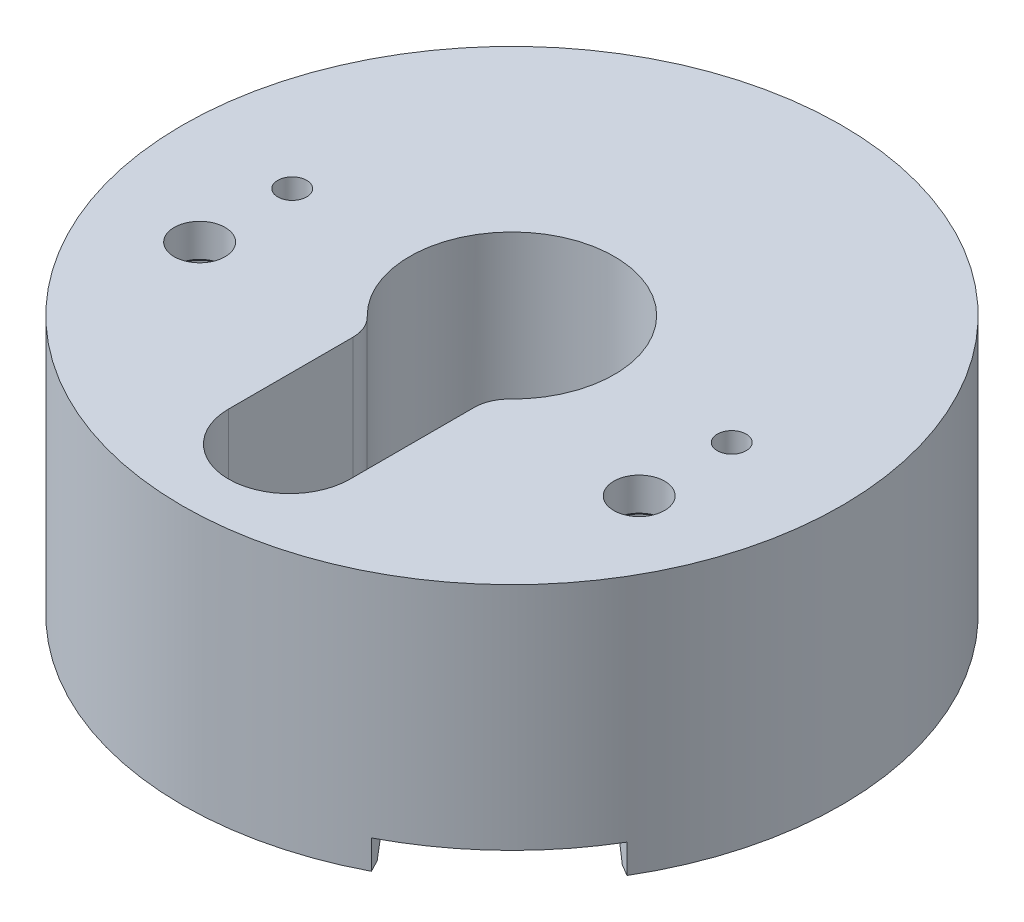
ISO-10303-21;
HEADER;
FILE_DESCRIPTION(('STEP AP214'),'2;1');
FILE_NAME('part.step','',(''),(''),'','','');
FILE_SCHEMA(('AUTOMOTIVE_DESIGN { 1 0 10303 214 1 1 1 1 }'));
ENDSEC;
DATA;
#1=APPLICATION_CONTEXT('core data for automotive mechanical design processes');
#2=APPLICATION_PROTOCOL_DEFINITION('international standard','automotive_design',2000,#1);
#3=PRODUCT_CONTEXT('',#1,'mechanical');
#4=PRODUCT('Part','Part','',(#3));
#5=PRODUCT_RELATED_PRODUCT_CATEGORY('part','',(#4));
#6=PRODUCT_DEFINITION_FORMATION('','',#4);
#7=PRODUCT_DEFINITION_CONTEXT('part definition',#1,'design');
#8=PRODUCT_DEFINITION('design','',#6,#7);
#9=PRODUCT_DEFINITION_SHAPE('','',#8);
#10=(LENGTH_UNIT() NAMED_UNIT(*) SI_UNIT(.MILLI.,.METRE.));
#11=(NAMED_UNIT(*) PLANE_ANGLE_UNIT() SI_UNIT($,.RADIAN.));
#12=(NAMED_UNIT(*) SI_UNIT($,.STERADIAN.) SOLID_ANGLE_UNIT());
#13=UNCERTAINTY_MEASURE_WITH_UNIT(LENGTH_MEASURE(1.E-05),#10,'distance_accuracy_value','');
#14=(GEOMETRIC_REPRESENTATION_CONTEXT(3) GLOBAL_UNCERTAINTY_ASSIGNED_CONTEXT((#13)) GLOBAL_UNIT_ASSIGNED_CONTEXT((#10,
#11,#12)) REPRESENTATION_CONTEXT('',''));
#15=CARTESIAN_POINT('',(0.,0.,0.));
#16=DIRECTION('',(0.,0.,1.));
#17=DIRECTION('',(1.,0.,0.));
#18=AXIS2_PLACEMENT_3D('',#15,#16,#17);
#19=CARTESIAN_POINT('',(19.,19.3,8.));
#20=DIRECTION('',(0.,1.,0.));
#21=DIRECTION('',(0.,0.,1.));
#22=AXIS2_PLACEMENT_3D('',#19,#20,#21);
#23=PLANE('',#22);
#24=CARTESIAN_POINT('',(19.,19.3,8.));
#25=DIRECTION('',(0.,-1.,0.));
#26=DIRECTION('',(0.,0.,-1.));
#27=AXIS2_PLACEMENT_3D('',#24,#25,#26);
#28=CIRCLE('',#27,2.54);
#29=CARTESIAN_POINT('',(19.,19.3,5.46000000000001));
#30=VERTEX_POINT('',#29);
#31=EDGE_CURVE('E358',#30,#30,#28,.T.);
#32=ORIENTED_EDGE('',*,*,#31,.T.);
#33=EDGE_LOOP('',(#32));
#34=FACE_BOUND('',#33,.T.);
#35=CARTESIAN_POINT('',(19.,19.3,8.));
#36=DIRECTION('',(0.,-1.,0.));
#37=DIRECTION('',(0.,0.,-1.));
#38=AXIS2_PLACEMENT_3D('',#35,#36,#37);
#39=CIRCLE('',#38,2.45);
#40=CARTESIAN_POINT('',(19.,19.3,5.55));
#41=VERTEX_POINT('',#40);
#42=EDGE_CURVE('E492',#41,#41,#39,.T.);
#43=ORIENTED_EDGE('',*,*,#42,.F.);
#44=EDGE_LOOP('',(#43));
#45=FACE_BOUND('',#44,.T.);
#46=ADVANCED_FACE('F46',(#34,#45),#23,.F.);
#47=CARTESIAN_POINT('',(0.,22.4,0.));
#48=DIRECTION('',(0.,-1.,0.));
#49=DIRECTION('',(0.,0.,-1.));
#50=AXIS2_PLACEMENT_3D('',#47,#48,#49);
#51=CYLINDRICAL_SURFACE('',#50,28.5);
#52=CARTESIAN_POINT('',(0.,22.4,0.));
#53=DIRECTION('',(0.,1.,0.));
#54=DIRECTION('',(0.,0.,1.));
#55=AXIS2_PLACEMENT_3D('',#52,#53,#54);
#56=CIRCLE('',#55,28.5);
#57=CARTESIAN_POINT('',(0.,22.4,28.5));
#58=VERTEX_POINT('',#57);
#59=EDGE_CURVE('E163',#58,#58,#56,.T.);
#60=ORIENTED_EDGE('',*,*,#59,.F.);
#61=EDGE_LOOP('',(#60));
#62=FACE_BOUND('',#61,.T.);
#63=DIRECTION('',(0.,1.,0.));
#64=VECTOR('',#63,1.);
#65=CARTESIAN_POINT('',(13.1377696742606,-17.3139711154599,25.2912832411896));
#66=LINE('',#65,#64);
#67=CARTESIAN_POINT('',(13.1377696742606,0.,25.2912832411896));
#68=VERTEX_POINT('',#67);
#69=CARTESIAN_POINT('',(13.1377696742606,2.5,25.2912832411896));
#70=VERTEX_POINT('',#69);
#71=EDGE_CURVE('E438',#68,#70,#66,.T.);
#72=ORIENTED_EDGE('',*,*,#71,.T.);
#73=CARTESIAN_POINT('',(0.,2.5,0.));
#74=DIRECTION('',(0.,-1.,0.));
#75=DIRECTION('',(0.,0.,-1.));
#76=AXIS2_PLACEMENT_3D('',#73,#74,#75);
#77=CIRCLE('',#76,28.5);
#78=CARTESIAN_POINT('',(24.5028358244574,2.5,14.5554469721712));
#79=VERTEX_POINT('',#78);
#80=EDGE_CURVE('E136',#79,#70,#77,.T.);
#81=ORIENTED_EDGE('',*,*,#80,.F.);
#82=DIRECTION('',(0.,1.,0.));
#83=VECTOR('',#82,1.);
#84=CARTESIAN_POINT('',(24.5028358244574,-17.3139711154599,14.5554469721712));
#85=LINE('',#84,#83);
#86=CARTESIAN_POINT('',(24.5028358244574,0.,14.5554469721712));
#87=VERTEX_POINT('',#86);
#88=EDGE_CURVE('E131',#87,#79,#85,.T.);
#89=ORIENTED_EDGE('',*,*,#88,.F.);
#90=CARTESIAN_POINT('',(0.,0.,0.));
#91=DIRECTION('',(0.,1.,0.));
#92=DIRECTION('',(0.,0.,1.));
#93=AXIS2_PLACEMENT_3D('',#90,#91,#92);
#94=CIRCLE('',#93,28.5);
#95=EDGE_CURVE('E156',#87,#68,#94,.T.);
#96=ORIENTED_EDGE('',*,*,#95,.T.);
#97=EDGE_LOOP('',(#72,#81,#89,#96));
#98=FACE_BOUND('',#97,.T.);
#99=ADVANCED_FACE('F251',(#62,#98),#51,.T.);
#100=CARTESIAN_POINT('',(0.,0.,0.));
#101=DIRECTION('',(0.,1.,0.));
#102=DIRECTION('',(0.,0.,1.));
#103=AXIS2_PLACEMENT_3D('',#100,#101,#102);
#104=PLANE('',#103);
#105=DIRECTION('',(0.460974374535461,0.,0.887413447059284));
#106=VECTOR('',#105,1.);
#107=CARTESIAN_POINT('',(13.1377696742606,0.,25.2912832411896));
#108=LINE('',#107,#106);
#109=CARTESIAN_POINT('',(12.5961247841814,0.,24.248572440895));
#110=VERTEX_POINT('',#109);
#111=EDGE_CURVE('E446',#110,#68,#108,.T.);
#112=ORIENTED_EDGE('',*,*,#111,.T.);
#113=ORIENTED_EDGE('',*,*,#95,.F.);
#114=DIRECTION('',(-0.859748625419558,0.,-0.510717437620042));
#115=VECTOR('',#114,1.);
#116=CARTESIAN_POINT('',(22.3974716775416,0.,13.3047951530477));
#117=LINE('',#116,#115);
#118=CARTESIAN_POINT('',(23.4926311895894,0.,13.9553539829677));
#119=VERTEX_POINT('',#118);
#120=EDGE_CURVE('E149',#87,#119,#117,.T.);
#121=ORIENTED_EDGE('',*,*,#120,.T.);
#122=CARTESIAN_POINT('',(0.,0.,0.));
#123=DIRECTION('',(0.,-1.,0.));
#124=DIRECTION('',(0.,0.,-1.));
#125=AXIS2_PLACEMENT_3D('',#122,#123,#124);
#126=CIRCLE('',#125,27.325);
#127=EDGE_CURVE('E146',#110,#119,#126,.T.);
#128=ORIENTED_EDGE('',*,*,#127,.F.);
#129=EDGE_LOOP('',(#112,#113,#121,#128));
#130=FACE_BOUND('',#129,.T.);
#131=ADVANCED_FACE('F257',(#130),#104,.F.);
#132=CARTESIAN_POINT('',(0.,0.,0.));
#133=DIRECTION('',(0.,-1.,0.));
#134=DIRECTION('',(0.,0.,-1.));
#135=AXIS2_PLACEMENT_3D('',#132,#133,#134);
#136=CONICAL_SURFACE('',#135,27.325,0.47123889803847);
#137=DIRECTION('',(0.209277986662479,-0.891006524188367,0.402877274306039));
#138=VECTOR('',#137,1.);
#139=CARTESIAN_POINT('',(0.,53.6283320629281,0.));
#140=LINE('',#139,#138);
#141=CARTESIAN_POINT('',(12.008929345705,2.5,23.1181731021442));
#142=VERTEX_POINT('',#141);
#143=EDGE_CURVE('E148',#110,#142,#140,.F.);
#144=ORIENTED_EDGE('',*,*,#143,.F.);
#145=ORIENTED_EDGE('',*,*,#127,.T.);
#146=DIRECTION('',(-0.390317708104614,0.891006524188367,-0.231860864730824));
#147=VECTOR('',#146,1.);
#148=CARTESIAN_POINT('',(0.,53.6283320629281,0.));
#149=LINE('',#148,#147);
#150=CARTESIAN_POINT('',(22.3974716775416,2.5,13.3047951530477));
#151=VERTEX_POINT('',#150);
#152=EDGE_CURVE('E128',#151,#119,#149,.F.);
#153=ORIENTED_EDGE('',*,*,#152,.F.);
#154=CARTESIAN_POINT('',(0.,2.5,0.));
#155=DIRECTION('',(0.,-1.,0.));
#156=DIRECTION('',(0.,0.,-1.));
#157=AXIS2_PLACEMENT_3D('',#154,#155,#156);
#158=CIRCLE('',#157,26.0511863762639);
#159=EDGE_CURVE('E144',#142,#151,#158,.T.);
#160=ORIENTED_EDGE('',*,*,#159,.F.);
#161=EDGE_LOOP('',(#144,#145,#153,#160));
#162=FACE_BOUND('',#161,.T.);
#163=ADVANCED_FACE('F143',(#162),#136,.F.);
#164=CARTESIAN_POINT('',(0.,22.4,0.));
#165=DIRECTION('',(0.,1.,0.));
#166=DIRECTION('',(0.,0.,1.));
#167=AXIS2_PLACEMENT_3D('',#164,#165,#166);
#168=PLANE('',#167);
#169=CARTESIAN_POINT('',(19.,22.4,8.));
#170=DIRECTION('',(0.,1.,0.));
#171=DIRECTION('',(0.,0.,1.));
#172=AXIS2_PLACEMENT_3D('',#169,#170,#171);
#173=CIRCLE('',#172,2.19999999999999);
#174=CARTESIAN_POINT('',(19.,22.4,10.2));
#175=VERTEX_POINT('',#174);
#176=EDGE_CURVE('E211',#175,#175,#173,.T.);
#177=ORIENTED_EDGE('',*,*,#176,.F.);
#178=EDGE_LOOP('',(#177));
#179=FACE_BOUND('',#178,.T.);
#180=CARTESIAN_POINT('',(-19.,22.4,7.99999999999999));
#181=DIRECTION('',(0.,1.,0.));
#182=DIRECTION('',(0.,0.,1.));
#183=AXIS2_PLACEMENT_3D('',#180,#181,#182);
#184=CIRCLE('',#183,2.19999999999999);
#185=CARTESIAN_POINT('',(-19.,22.4,10.2));
#186=VERTEX_POINT('',#185);
#187=EDGE_CURVE('E137',#186,#186,#184,.T.);
#188=ORIENTED_EDGE('',*,*,#187,.F.);
#189=EDGE_LOOP('',(#188));
#190=FACE_BOUND('',#189,.T.);
#191=DIRECTION('',(0.,0.,1.));
#192=VECTOR('',#191,1.);
#193=CARTESIAN_POINT('',(-5.25,22.4,7.12460525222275));
#194=LINE('',#193,#192);
#195=CARTESIAN_POINT('',(-5.25,22.4,8.50646812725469));
#196=VERTEX_POINT('',#195);
#197=CARTESIAN_POINT('',(-5.25,22.4,19.25));
#198=VERTEX_POINT('',#197);
#199=EDGE_CURVE('E390',#196,#198,#194,.T.);
#200=ORIENTED_EDGE('',*,*,#199,.F.);
#201=CARTESIAN_POINT('',(-8.25,22.4,8.50646812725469));
#202=DIRECTION('',(0.,1.,0.));
#203=DIRECTION('',(0.,0.,1.));
#204=AXIS2_PLACEMENT_3D('',#201,#202,#203);
#205=CIRCLE('',#204,3.);
#206=CARTESIAN_POINT('',(-6.16139240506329,22.4,6.35293189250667));
#207=VERTEX_POINT('',#206);
#208=EDGE_CURVE('E180',#196,#207,#205,.T.);
#209=ORIENTED_EDGE('',*,*,#208,.T.);
#210=CARTESIAN_POINT('',(0.,22.4,0.));
#211=DIRECTION('',(0.,1.,0.));
#212=DIRECTION('',(0.,0.,1.));
#213=AXIS2_PLACEMENT_3D('',#210,#211,#212);
#214=CIRCLE('',#213,8.85);
#215=CARTESIAN_POINT('',(6.16139240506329,22.4,6.35293189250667));
#216=VERTEX_POINT('',#215);
#217=EDGE_CURVE('E375',#216,#207,#214,.T.);
#218=ORIENTED_EDGE('',*,*,#217,.F.);
#219=CARTESIAN_POINT('',(8.25,22.4,8.50646812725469));
#220=DIRECTION('',(0.,1.,0.));
#221=DIRECTION('',(0.,0.,1.));
#222=AXIS2_PLACEMENT_3D('',#219,#220,#221);
#223=CIRCLE('',#222,3.);
#224=CARTESIAN_POINT('',(5.25,22.4,8.50646812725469));
#225=VERTEX_POINT('',#224);
#226=EDGE_CURVE('E177',#216,#225,#223,.T.);
#227=ORIENTED_EDGE('',*,*,#226,.T.);
#228=DIRECTION('',(0.,0.,-1.));
#229=VECTOR('',#228,1.);
#230=CARTESIAN_POINT('',(5.25,22.4,7.12460525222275));
#231=LINE('',#230,#229);
#232=CARTESIAN_POINT('',(5.25,22.4,19.25));
#233=VERTEX_POINT('',#232);
#234=EDGE_CURVE('E380',#233,#225,#231,.T.);
#235=ORIENTED_EDGE('',*,*,#234,.F.);
#236=CARTESIAN_POINT('',(0.,22.4,19.25));
#237=DIRECTION('',(0.,1.,0.));
#238=DIRECTION('',(0.,0.,1.));
#239=AXIS2_PLACEMENT_3D('',#236,#237,#238);
#240=CIRCLE('',#239,5.25);
#241=EDGE_CURVE('E393',#198,#233,#240,.T.);
#242=ORIENTED_EDGE('',*,*,#241,.F.);
#243=EDGE_LOOP('',(#200,#209,#218,#227,#235,#242));
#244=FACE_BOUND('',#243,.T.);
#245=CARTESIAN_POINT('',(19.,22.4,0.));
#246=DIRECTION('',(0.,-1.,0.));
#247=DIRECTION('',(0.,0.,-1.));
#248=AXIS2_PLACEMENT_3D('',#245,#246,#247);
#249=CIRCLE('',#248,1.24999999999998);
#250=CARTESIAN_POINT('',(19.,22.4,-1.24999999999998));
#251=VERTEX_POINT('',#250);
#252=EDGE_CURVE('E412',#251,#251,#249,.T.);
#253=ORIENTED_EDGE('',*,*,#252,.T.);
#254=EDGE_LOOP('',(#253));
#255=FACE_BOUND('',#254,.T.);
#256=CARTESIAN_POINT('',(-19.,22.4,0.));
#257=DIRECTION('',(0.,-1.,0.));
#258=DIRECTION('',(0.,0.,-1.));
#259=AXIS2_PLACEMENT_3D('',#256,#257,#258);
#260=CIRCLE('',#259,1.24999999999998);
#261=CARTESIAN_POINT('',(-19.,22.4,-1.24999999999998));
#262=VERTEX_POINT('',#261);
#263=EDGE_CURVE('E166',#262,#262,#260,.T.);
#264=ORIENTED_EDGE('',*,*,#263,.T.);
#265=EDGE_LOOP('',(#264));
#266=FACE_BOUND('',#265,.T.);
#267=ORIENTED_EDGE('',*,*,#59,.T.);
#268=EDGE_LOOP('',(#267));
#269=FACE_BOUND('',#268,.T.);
#270=ADVANCED_FACE('F317',(#179,#190,#244,#255,#266,#269),#168,.T.);
#271=CARTESIAN_POINT('',(0.,2.5,0.));
#272=DIRECTION('',(0.,-1.,0.));
#273=DIRECTION('',(0.,0.,-1.));
#274=AXIS2_PLACEMENT_3D('',#271,#272,#273);
#275=PLANE('',#274);
#276=CARTESIAN_POINT('',(-19.,2.5,7.99999999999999));
#277=DIRECTION('',(0.,-1.,0.));
#278=DIRECTION('',(0.,0.,-1.));
#279=AXIS2_PLACEMENT_3D('',#276,#277,#278);
#280=CIRCLE('',#279,4.);
#281=CARTESIAN_POINT('',(-19.,2.5,3.99999999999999));
#282=VERTEX_POINT('',#281);
#283=EDGE_CURVE('E224',#282,#282,#280,.F.);
#284=ORIENTED_EDGE('',*,*,#283,.T.);
#285=EDGE_LOOP('',(#284));
#286=FACE_BOUND('',#285,.T.);
#287=CARTESIAN_POINT('',(19.,2.5,8.));
#288=DIRECTION('',(0.,-1.,0.));
#289=DIRECTION('',(0.,0.,-1.));
#290=AXIS2_PLACEMENT_3D('',#287,#288,#289);
#291=CIRCLE('',#290,4.);
#292=CARTESIAN_POINT('',(19.,2.5,4.));
#293=VERTEX_POINT('',#292);
#294=EDGE_CURVE('E220',#293,#293,#291,.F.);
#295=ORIENTED_EDGE('',*,*,#294,.T.);
#296=EDGE_LOOP('',(#295));
#297=FACE_BOUND('',#296,.T.);
#298=CARTESIAN_POINT('',(0.,2.5,0.));
#299=DIRECTION('',(0.,-1.,0.));
#300=DIRECTION('',(0.,0.,-1.));
#301=AXIS2_PLACEMENT_3D('',#298,#299,#300);
#302=CIRCLE('',#301,9.85);
#303=CARTESIAN_POINT('',(0.,2.5,-9.85));
#304=VERTEX_POINT('',#303);
#305=EDGE_CURVE('E202',#304,#304,#302,.F.);
#306=ORIENTED_EDGE('',*,*,#305,.T.);
#307=EDGE_LOOP('',(#306));
#308=FACE_BOUND('',#307,.T.);
#309=CARTESIAN_POINT('',(19.,2.5,0.));
#310=DIRECTION('',(0.,-1.,0.));
#311=DIRECTION('',(0.,0.,-1.));
#312=AXIS2_PLACEMENT_3D('',#309,#310,#311);
#313=CIRCLE('',#312,1.4);
#314=CARTESIAN_POINT('',(19.,2.5,-1.4));
#315=VERTEX_POINT('',#314);
#316=EDGE_CURVE('E401',#315,#315,#313,.T.);
#317=ORIENTED_EDGE('',*,*,#316,.F.);
#318=EDGE_LOOP('',(#317));
#319=FACE_BOUND('',#318,.T.);
#320=CARTESIAN_POINT('',(-19.,2.5,0.));
#321=DIRECTION('',(0.,-1.,0.));
#322=DIRECTION('',(0.,0.,-1.));
#323=AXIS2_PLACEMENT_3D('',#320,#321,#322);
#324=CIRCLE('',#323,1.4);
#325=CARTESIAN_POINT('',(-19.,2.5,-1.4));
#326=VERTEX_POINT('',#325);
#327=EDGE_CURVE('E416',#326,#326,#324,.T.);
#328=ORIENTED_EDGE('',*,*,#327,.F.);
#329=EDGE_LOOP('',(#328));
#330=FACE_BOUND('',#329,.T.);
#331=ORIENTED_EDGE('',*,*,#159,.T.);
#332=DIRECTION('',(0.859748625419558,0.,0.510717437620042));
#333=VECTOR('',#332,1.);
#334=CARTESIAN_POINT('',(22.3974716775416,2.5,13.3047951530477));
#335=LINE('',#334,#333);
#336=EDGE_CURVE('E125',#151,#79,#335,.T.);
#337=ORIENTED_EDGE('',*,*,#336,.T.);
#338=ORIENTED_EDGE('',*,*,#80,.T.);
#339=DIRECTION('',(-0.460974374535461,0.,-0.887413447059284));
#340=VECTOR('',#339,1.);
#341=CARTESIAN_POINT('',(13.1377696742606,2.5,25.2912832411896));
#342=LINE('',#341,#340);
#343=EDGE_CURVE('E153',#70,#142,#342,.T.);
#344=ORIENTED_EDGE('',*,*,#343,.T.);
#345=EDGE_LOOP('',(#331,#337,#338,#344));
#346=FACE_BOUND('',#345,.T.);
#347=ADVANCED_FACE('F151',(#286,#297,#308,#319,#330,#346),#275,.T.);
#348=CARTESIAN_POINT('',(-19.,2.5,0.));
#349=DIRECTION('',(0.,-1.,0.));
#350=DIRECTION('',(0.,0.,-1.));
#351=AXIS2_PLACEMENT_3D('',#348,#349,#350);
#352=CYLINDRICAL_SURFACE('',#351,1.24999999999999);
#353=ORIENTED_EDGE('',*,*,#263,.F.);
#354=EDGE_LOOP('',(#353));
#355=FACE_BOUND('',#354,.T.);
#356=CARTESIAN_POINT('',(-19.,2.65,0.));
#357=DIRECTION('',(0.,-1.,0.));
#358=DIRECTION('',(0.,0.,-1.));
#359=AXIS2_PLACEMENT_3D('',#356,#357,#358);
#360=CIRCLE('',#359,1.25);
#361=CARTESIAN_POINT('',(-19.,2.65,-1.25));
#362=VERTEX_POINT('',#361);
#363=EDGE_CURVE('E420',#362,#362,#360,.T.);
#364=ORIENTED_EDGE('',*,*,#363,.T.);
#365=EDGE_LOOP('',(#364));
#366=FACE_BOUND('',#365,.T.);
#367=ADVANCED_FACE('F310',(#355,#366),#352,.F.);
#368=CARTESIAN_POINT('',(-19.,2.5,0.));
#369=DIRECTION('',(0.,-1.,0.));
#370=DIRECTION('',(0.,0.,-1.));
#371=AXIS2_PLACEMENT_3D('',#368,#369,#370);
#372=CONICAL_SURFACE('',#371,1.4,0.785398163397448);
#373=ORIENTED_EDGE('',*,*,#363,.F.);
#374=EDGE_LOOP('',(#373));
#375=FACE_BOUND('',#374,.T.);
#376=ORIENTED_EDGE('',*,*,#327,.T.);
#377=EDGE_LOOP('',(#376));
#378=FACE_BOUND('',#377,.T.);
#379=ADVANCED_FACE('F306',(#375,#378),#372,.F.);
#380=CARTESIAN_POINT('',(19.,2.5,0.));
#381=DIRECTION('',(0.,-1.,0.));
#382=DIRECTION('',(0.,0.,-1.));
#383=AXIS2_PLACEMENT_3D('',#380,#381,#382);
#384=CYLINDRICAL_SURFACE('',#383,1.24999999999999);
#385=ORIENTED_EDGE('',*,*,#252,.F.);
#386=EDGE_LOOP('',(#385));
#387=FACE_BOUND('',#386,.T.);
#388=CARTESIAN_POINT('',(19.,2.65,0.));
#389=DIRECTION('',(0.,-1.,0.));
#390=DIRECTION('',(0.,0.,-1.));
#391=AXIS2_PLACEMENT_3D('',#388,#389,#390);
#392=CIRCLE('',#391,1.25);
#393=CARTESIAN_POINT('',(19.,2.65,-1.25));
#394=VERTEX_POINT('',#393);
#395=EDGE_CURVE('E408',#394,#394,#392,.T.);
#396=ORIENTED_EDGE('',*,*,#395,.T.);
#397=EDGE_LOOP('',(#396));
#398=FACE_BOUND('',#397,.T.);
#399=ADVANCED_FACE('F302',(#387,#398),#384,.F.);
#400=CARTESIAN_POINT('',(19.,2.5,0.));
#401=DIRECTION('',(0.,-1.,0.));
#402=DIRECTION('',(0.,0.,-1.));
#403=AXIS2_PLACEMENT_3D('',#400,#401,#402);
#404=CONICAL_SURFACE('',#403,1.4,0.785398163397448);
#405=ORIENTED_EDGE('',*,*,#395,.F.);
#406=EDGE_LOOP('',(#405));
#407=FACE_BOUND('',#406,.T.);
#408=ORIENTED_EDGE('',*,*,#316,.T.);
#409=EDGE_LOOP('',(#408));
#410=FACE_BOUND('',#409,.T.);
#411=ADVANCED_FACE('F298',(#407,#410),#404,.F.);
#412=CARTESIAN_POINT('',(0.,8.4,0.));
#413=DIRECTION('',(0.,1.,0.));
#414=DIRECTION('',(0.,0.,1.));
#415=AXIS2_PLACEMENT_3D('',#412,#413,#414);
#416=CYLINDRICAL_SURFACE('',#415,8.85);
#417=CARTESIAN_POINT('',(0.,3.5,0.));
#418=DIRECTION('',(0.,-1.,0.));
#419=DIRECTION('',(0.,0.,-1.));
#420=AXIS2_PLACEMENT_3D('',#417,#418,#419);
#421=CIRCLE('',#420,8.85);
#422=CARTESIAN_POINT('',(0.,3.5,-8.85));
#423=VERTEX_POINT('',#422);
#424=EDGE_CURVE('E198',#423,#423,#421,.T.);
#425=ORIENTED_EDGE('',*,*,#424,.T.);
#426=EDGE_LOOP('',(#425));
#427=FACE_BOUND('',#426,.T.);
#428=ORIENTED_EDGE('',*,*,#217,.T.);
#429=DIRECTION('',(0.,1.,0.));
#430=VECTOR('',#429,1.);
#431=CARTESIAN_POINT('',(-6.16139240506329,8.4,6.35293189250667));
#432=LINE('',#431,#430);
#433=CARTESIAN_POINT('',(-6.16139240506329,8.4,6.35293189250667));
#434=VERTEX_POINT('',#433);
#435=EDGE_CURVE('E187',#207,#434,#432,.F.);
#436=ORIENTED_EDGE('',*,*,#435,.T.);
#437=CARTESIAN_POINT('',(0.,8.4,0.));
#438=DIRECTION('',(0.,1.,0.));
#439=DIRECTION('',(0.,0.,1.));
#440=AXIS2_PLACEMENT_3D('',#437,#438,#439);
#441=CIRCLE('',#440,8.85);
#442=CARTESIAN_POINT('',(6.16139240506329,8.4,6.35293189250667));
#443=VERTEX_POINT('',#442);
#444=EDGE_CURVE('E70',#434,#443,#441,.T.);
#445=ORIENTED_EDGE('',*,*,#444,.T.);
#446=DIRECTION('',(0.,1.,0.));
#447=VECTOR('',#446,1.);
#448=CARTESIAN_POINT('',(6.16139240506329,8.4,6.35293189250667));
#449=LINE('',#448,#447);
#450=EDGE_CURVE('E183',#443,#216,#449,.T.);
#451=ORIENTED_EDGE('',*,*,#450,.T.);
#452=EDGE_LOOP('',(#428,#436,#445,#451));
#453=FACE_BOUND('',#452,.T.);
#454=ADVANCED_FACE('F289',(#427,#453),#416,.F.);
#455=CARTESIAN_POINT('',(5.25,8.4,7.12460525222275));
#456=DIRECTION('',(1.,0.,0.));
#457=DIRECTION('',(0.,0.,-1.));
#458=AXIS2_PLACEMENT_3D('',#455,#456,#457);
#459=PLANE('',#458);
#460=ORIENTED_EDGE('',*,*,#234,.T.);
#461=DIRECTION('',(0.,1.,0.));
#462=VECTOR('',#461,1.);
#463=CARTESIAN_POINT('',(5.25,8.4,8.50646812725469));
#464=LINE('',#463,#462);
#465=CARTESIAN_POINT('',(5.25,8.4,8.50646812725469));
#466=VERTEX_POINT('',#465);
#467=EDGE_CURVE('E62',#225,#466,#464,.F.);
#468=ORIENTED_EDGE('',*,*,#467,.T.);
#469=DIRECTION('',(0.,0.,-1.));
#470=VECTOR('',#469,1.);
#471=CARTESIAN_POINT('',(5.25,8.4,7.12460525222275));
#472=LINE('',#471,#470);
#473=CARTESIAN_POINT('',(5.25,8.4,19.25));
#474=VERTEX_POINT('',#473);
#475=EDGE_CURVE('E384',#474,#466,#472,.T.);
#476=ORIENTED_EDGE('',*,*,#475,.F.);
#477=DIRECTION('',(0.,1.,0.));
#478=VECTOR('',#477,1.);
#479=CARTESIAN_POINT('',(5.25,8.4,19.25));
#480=LINE('',#479,#478);
#481=EDGE_CURVE('E398',#474,#233,#480,.T.);
#482=ORIENTED_EDGE('',*,*,#481,.T.);
#483=EDGE_LOOP('',(#460,#468,#476,#482));
#484=FACE_BOUND('',#483,.T.);
#485=ADVANCED_FACE('F285',(#484),#459,.F.);
#486=CARTESIAN_POINT('',(0.,8.4,19.25));
#487=DIRECTION('',(0.,1.,0.));
#488=DIRECTION('',(0.,0.,1.));
#489=AXIS2_PLACEMENT_3D('',#486,#487,#488);
#490=CYLINDRICAL_SURFACE('',#489,5.25);
#491=ORIENTED_EDGE('',*,*,#241,.T.);
#492=ORIENTED_EDGE('',*,*,#481,.F.);
#493=CARTESIAN_POINT('',(0.,8.4,19.25));
#494=DIRECTION('',(0.,1.,0.));
#495=DIRECTION('',(0.,0.,1.));
#496=AXIS2_PLACEMENT_3D('',#493,#494,#495);
#497=CIRCLE('',#496,5.25);
#498=CARTESIAN_POINT('',(-5.25,8.4,19.25));
#499=VERTEX_POINT('',#498);
#500=EDGE_CURVE('E379',#499,#474,#497,.T.);
#501=ORIENTED_EDGE('',*,*,#500,.F.);
#502=DIRECTION('',(0.,1.,0.));
#503=VECTOR('',#502,1.);
#504=CARTESIAN_POINT('',(-5.25,8.4,19.25));
#505=LINE('',#504,#503);
#506=EDGE_CURVE('E387',#499,#198,#505,.T.);
#507=ORIENTED_EDGE('',*,*,#506,.T.);
#508=EDGE_LOOP('',(#491,#492,#501,#507));
#509=FACE_BOUND('',#508,.T.);
#510=ADVANCED_FACE('F288',(#509),#490,.F.);
#511=CARTESIAN_POINT('',(-5.25,8.4,7.12460525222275));
#512=DIRECTION('',(-1.,0.,0.));
#513=DIRECTION('',(0.,0.,1.));
#514=AXIS2_PLACEMENT_3D('',#511,#512,#513);
#515=PLANE('',#514);
#516=DIRECTION('',(0.,0.,1.));
#517=VECTOR('',#516,1.);
#518=CARTESIAN_POINT('',(-5.25,8.4,7.12460525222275));
#519=LINE('',#518,#517);
#520=CARTESIAN_POINT('',(-5.25,8.4,8.50646812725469));
#521=VERTEX_POINT('',#520);
#522=EDGE_CURVE('E376',#521,#499,#519,.T.);
#523=ORIENTED_EDGE('',*,*,#522,.F.);
#524=DIRECTION('',(0.,1.,0.));
#525=VECTOR('',#524,1.);
#526=CARTESIAN_POINT('',(-5.25,8.4,8.50646812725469));
#527=LINE('',#526,#525);
#528=EDGE_CURVE('E172',#521,#196,#527,.T.);
#529=ORIENTED_EDGE('',*,*,#528,.T.);
#530=ORIENTED_EDGE('',*,*,#199,.T.);
#531=ORIENTED_EDGE('',*,*,#506,.F.);
#532=EDGE_LOOP('',(#523,#529,#530,#531));
#533=FACE_BOUND('',#532,.T.);
#534=ADVANCED_FACE('F284',(#533),#515,.F.);
#535=CARTESIAN_POINT('',(0.,8.4,0.));
#536=DIRECTION('',(0.,1.,0.));
#537=DIRECTION('',(0.,0.,1.));
#538=AXIS2_PLACEMENT_3D('',#535,#536,#537);
#539=PLANE('',#538);
#540=ORIENTED_EDGE('',*,*,#444,.F.);
#541=CARTESIAN_POINT('',(-8.25,8.4,8.50646812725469));
#542=DIRECTION('',(0.,1.,0.));
#543=DIRECTION('',(0.,0.,1.));
#544=AXIS2_PLACEMENT_3D('',#541,#542,#543);
#545=CIRCLE('',#544,3.);
#546=EDGE_CURVE('E192',#434,#521,#545,.F.);
#547=ORIENTED_EDGE('',*,*,#546,.T.);
#548=ORIENTED_EDGE('',*,*,#522,.T.);
#549=ORIENTED_EDGE('',*,*,#500,.T.);
#550=ORIENTED_EDGE('',*,*,#475,.T.);
#551=CARTESIAN_POINT('',(8.25,8.4,8.50646812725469));
#552=DIRECTION('',(0.,1.,0.));
#553=DIRECTION('',(0.,0.,1.));
#554=AXIS2_PLACEMENT_3D('',#551,#552,#553);
#555=CIRCLE('',#554,3.);
#556=EDGE_CURVE('E195',#466,#443,#555,.F.);
#557=ORIENTED_EDGE('',*,*,#556,.T.);
#558=EDGE_LOOP('',(#540,#547,#548,#549,#550,#557));
#559=FACE_BOUND('',#558,.T.);
#560=ADVANCED_FACE('F280',(#559),#539,.T.);
#561=CARTESIAN_POINT('',(-19.,19.3,7.99999999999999));
#562=DIRECTION('',(0.,1.,0.));
#563=DIRECTION('',(0.,0.,1.));
#564=AXIS2_PLACEMENT_3D('',#561,#562,#563);
#565=PLANE('',#564);
#566=CARTESIAN_POINT('',(-19.,19.3,7.99999999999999));
#567=DIRECTION('',(0.,-1.,0.));
#568=DIRECTION('',(0.,0.,-1.));
#569=AXIS2_PLACEMENT_3D('',#566,#567,#568);
#570=CIRCLE('',#569,2.45);
#571=CARTESIAN_POINT('',(-19.,19.3,5.54999999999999));
#572=VERTEX_POINT('',#571);
#573=EDGE_CURVE('E215',#572,#572,#570,.T.);
#574=ORIENTED_EDGE('',*,*,#573,.F.);
#575=EDGE_LOOP('',(#574));
#576=FACE_BOUND('',#575,.T.);
#577=CARTESIAN_POINT('',(-19.,19.3,7.99999999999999));
#578=DIRECTION('',(0.,-1.,0.));
#579=DIRECTION('',(0.,0.,-1.));
#580=AXIS2_PLACEMENT_3D('',#577,#578,#579);
#581=CIRCLE('',#580,2.54);
#582=CARTESIAN_POINT('',(-19.,19.3,5.45999999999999));
#583=VERTEX_POINT('',#582);
#584=EDGE_CURVE('E363',#583,#583,#581,.T.);
#585=ORIENTED_EDGE('',*,*,#584,.T.);
#586=EDGE_LOOP('',(#585));
#587=FACE_BOUND('',#586,.T.);
#588=ADVANCED_FACE('F276',(#576,#587),#565,.F.);
#589=CARTESIAN_POINT('',(-19.,2.5,7.99999999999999));
#590=DIRECTION('',(0.,-1.,0.));
#591=DIRECTION('',(0.,0.,-1.));
#592=AXIS2_PLACEMENT_3D('',#589,#590,#591);
#593=CYLINDRICAL_SURFACE('',#592,2.54);
#594=ORIENTED_EDGE('',*,*,#584,.F.);
#595=EDGE_LOOP('',(#594));
#596=FACE_BOUND('',#595,.T.);
#597=CARTESIAN_POINT('',(-19.,4.86,7.99999999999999));
#598=DIRECTION('',(0.,-1.,0.));
#599=DIRECTION('',(0.,0.,-1.));
#600=AXIS2_PLACEMENT_3D('',#597,#598,#599);
#601=CIRCLE('',#600,2.54);
#602=CARTESIAN_POINT('',(-19.,4.86,5.45999999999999));
#603=VERTEX_POINT('',#602);
#604=EDGE_CURVE('E357',#603,#603,#601,.T.);
#605=ORIENTED_EDGE('',*,*,#604,.T.);
#606=EDGE_LOOP('',(#605));
#607=FACE_BOUND('',#606,.T.);
#608=ADVANCED_FACE('F272',(#596,#607),#593,.F.);
#609=CARTESIAN_POINT('',(-19.,3.8,7.99999999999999));
#610=DIRECTION('',(0.,-1.,0.));
#611=DIRECTION('',(0.,0.,-1.));
#612=AXIS2_PLACEMENT_3D('',#609,#610,#611);
#613=CONICAL_SURFACE('',#612,3.6,0.785398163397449);
#614=ORIENTED_EDGE('',*,*,#604,.F.);
#615=EDGE_LOOP('',(#614));
#616=FACE_BOUND('',#615,.T.);
#617=CARTESIAN_POINT('',(-19.,3.8,7.99999999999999));
#618=DIRECTION('',(0.,-1.,0.));
#619=DIRECTION('',(0.,0.,-1.));
#620=AXIS2_PLACEMENT_3D('',#617,#618,#619);
#621=CIRCLE('',#620,3.6);
#622=CARTESIAN_POINT('',(-19.,3.8,4.39999999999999));
#623=VERTEX_POINT('',#622);
#624=EDGE_CURVE('E355',#623,#623,#621,.T.);
#625=ORIENTED_EDGE('',*,*,#624,.T.);
#626=EDGE_LOOP('',(#625));
#627=FACE_BOUND('',#626,.T.);
#628=ADVANCED_FACE('F268',(#616,#627),#613,.F.);
#629=CARTESIAN_POINT('',(-19.,2.5,7.99999999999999));
#630=DIRECTION('',(0.,-1.,0.));
#631=DIRECTION('',(0.,0.,-1.));
#632=AXIS2_PLACEMENT_3D('',#629,#630,#631);
#633=CYLINDRICAL_SURFACE('',#632,3.6);
#634=CARTESIAN_POINT('',(-19.,2.9,7.99999999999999));
#635=DIRECTION('',(0.,-1.,0.));
#636=DIRECTION('',(0.,0.,-1.));
#637=AXIS2_PLACEMENT_3D('',#634,#635,#636);
#638=CIRCLE('',#637,3.6);
#639=CARTESIAN_POINT('',(-19.,2.9,4.39999999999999));
#640=VERTEX_POINT('',#639);
#641=EDGE_CURVE('E206',#640,#640,#638,.T.);
#642=ORIENTED_EDGE('',*,*,#641,.T.);
#643=EDGE_LOOP('',(#642));
#644=FACE_BOUND('',#643,.T.);
#645=ORIENTED_EDGE('',*,*,#624,.F.);
#646=EDGE_LOOP('',(#645));
#647=FACE_BOUND('',#646,.T.);
#648=ADVANCED_FACE('F265',(#644,#647),#633,.F.);
#649=CARTESIAN_POINT('',(19.,2.5,8.));
#650=DIRECTION('',(0.,-1.,0.));
#651=DIRECTION('',(0.,0.,-1.));
#652=AXIS2_PLACEMENT_3D('',#649,#650,#651);
#653=CYLINDRICAL_SURFACE('',#652,2.54);
#654=CARTESIAN_POINT('',(19.,5.02568542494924,8.));
#655=DIRECTION('',(0.,1.,0.));
#656=DIRECTION('',(0.,0.,1.));
#657=AXIS2_PLACEMENT_3D('',#654,#655,#656);
#658=CIRCLE('',#657,2.54);
#659=CARTESIAN_POINT('',(19.,5.02568542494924,10.54));
#660=VERTEX_POINT('',#659);
#661=EDGE_CURVE('E55',#660,#660,#658,.F.);
#662=ORIENTED_EDGE('',*,*,#661,.T.);
#663=EDGE_LOOP('',(#662));
#664=FACE_BOUND('',#663,.T.);
#665=ORIENTED_EDGE('',*,*,#31,.F.);
#666=EDGE_LOOP('',(#665));
#667=FACE_BOUND('',#666,.T.);
#668=ADVANCED_FACE('F238',(#664,#667),#653,.F.);
#669=CARTESIAN_POINT('',(19.,3.8,8.));
#670=DIRECTION('',(0.,-1.,0.));
#671=DIRECTION('',(0.,0.,-1.));
#672=AXIS2_PLACEMENT_3D('',#669,#670,#671);
#673=CONICAL_SURFACE('',#672,3.6,0.785398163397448);
#674=CARTESIAN_POINT('',(19.,4.74284271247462,8.));
#675=DIRECTION('',(0.,1.,0.));
#676=DIRECTION('',(0.,0.,1.));
#677=AXIS2_PLACEMENT_3D('',#674,#675,#676);
#678=CIRCLE('',#677,2.65715728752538);
#679=CARTESIAN_POINT('',(19.,4.74284271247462,10.6571572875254));
#680=VERTEX_POINT('',#679);
#681=EDGE_CURVE('E11',#680,#680,#678,.T.);
#682=ORIENTED_EDGE('',*,*,#681,.T.);
#683=EDGE_LOOP('',(#682));
#684=FACE_BOUND('',#683,.T.);
#685=CARTESIAN_POINT('',(19.,3.8,8.));
#686=DIRECTION('',(0.,-1.,0.));
#687=DIRECTION('',(0.,0.,-1.));
#688=AXIS2_PLACEMENT_3D('',#685,#686,#687);
#689=CIRCLE('',#688,3.6);
#690=CARTESIAN_POINT('',(19.,3.8,4.4));
#691=VERTEX_POINT('',#690);
#692=EDGE_CURVE('E366',#691,#691,#689,.T.);
#693=ORIENTED_EDGE('',*,*,#692,.T.);
#694=EDGE_LOOP('',(#693));
#695=FACE_BOUND('',#694,.T.);
#696=ADVANCED_FACE('F460',(#684,#695),#673,.F.);
#697=CARTESIAN_POINT('',(19.,2.5,8.));
#698=DIRECTION('',(0.,-1.,0.));
#699=DIRECTION('',(0.,0.,-1.));
#700=AXIS2_PLACEMENT_3D('',#697,#698,#699);
#701=CYLINDRICAL_SURFACE('',#700,3.6);
#702=CARTESIAN_POINT('',(19.,2.9,8.));
#703=DIRECTION('',(0.,-1.,0.));
#704=DIRECTION('',(0.,0.,-1.));
#705=AXIS2_PLACEMENT_3D('',#702,#703,#704);
#706=CIRCLE('',#705,3.6);
#707=CARTESIAN_POINT('',(19.,2.9,4.4));
#708=VERTEX_POINT('',#707);
#709=EDGE_CURVE('E228',#708,#708,#706,.T.);
#710=ORIENTED_EDGE('',*,*,#709,.T.);
#711=EDGE_LOOP('',(#710));
#712=FACE_BOUND('',#711,.T.);
#713=ORIENTED_EDGE('',*,*,#692,.F.);
#714=EDGE_LOOP('',(#713));
#715=FACE_BOUND('',#714,.T.);
#716=ADVANCED_FACE('F462',(#712,#715),#701,.F.);
#717=CARTESIAN_POINT('',(13.1377696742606,-17.3139711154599,25.2912832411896));
#718=DIRECTION('',(0.887413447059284,0.,-0.460974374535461));
#719=DIRECTION('',(-0.460974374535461,0.,-0.887413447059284));
#720=AXIS2_PLACEMENT_3D('',#717,#718,#719);
#721=PLANE('',#720);
#722=ORIENTED_EDGE('',*,*,#143,.T.);
#723=ORIENTED_EDGE('',*,*,#343,.F.);
#724=ORIENTED_EDGE('',*,*,#71,.F.);
#725=ORIENTED_EDGE('',*,*,#111,.F.);
#726=EDGE_LOOP('',(#722,#723,#724,#725));
#727=FACE_BOUND('',#726,.T.);
#728=ADVANCED_FACE('F464',(#727),#721,.T.);
#729=CARTESIAN_POINT('',(22.3974716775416,-17.3139711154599,13.3047951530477));
#730=DIRECTION('',(-0.510717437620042,0.,0.859748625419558));
#731=DIRECTION('',(0.859748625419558,0.,0.510717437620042));
#732=AXIS2_PLACEMENT_3D('',#729,#730,#731);
#733=PLANE('',#732);
#734=ORIENTED_EDGE('',*,*,#152,.T.);
#735=ORIENTED_EDGE('',*,*,#120,.F.);
#736=ORIENTED_EDGE('',*,*,#88,.T.);
#737=ORIENTED_EDGE('',*,*,#336,.F.);
#738=EDGE_LOOP('',(#734,#735,#736,#737));
#739=FACE_BOUND('',#738,.T.);
#740=ADVANCED_FACE('F127',(#739),#733,.T.);
#741=CARTESIAN_POINT('',(-8.25,8.4,8.50646812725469));
#742=DIRECTION('',(0.,1.,0.));
#743=DIRECTION('',(0.,0.,1.));
#744=AXIS2_PLACEMENT_3D('',#741,#742,#743);
#745=CYLINDRICAL_SURFACE('',#744,3.);
#746=ORIENTED_EDGE('',*,*,#546,.F.);
#747=ORIENTED_EDGE('',*,*,#435,.F.);
#748=ORIENTED_EDGE('',*,*,#208,.F.);
#749=ORIENTED_EDGE('',*,*,#528,.F.);
#750=EDGE_LOOP('',(#746,#747,#748,#749));
#751=FACE_BOUND('',#750,.T.);
#752=ADVANCED_FACE('F327',(#751),#745,.T.);
#753=CARTESIAN_POINT('',(8.25,8.4,8.50646812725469));
#754=DIRECTION('',(0.,1.,0.));
#755=DIRECTION('',(0.,0.,1.));
#756=AXIS2_PLACEMENT_3D('',#753,#754,#755);
#757=CYLINDRICAL_SURFACE('',#756,3.);
#758=ORIENTED_EDGE('',*,*,#556,.F.);
#759=ORIENTED_EDGE('',*,*,#467,.F.);
#760=ORIENTED_EDGE('',*,*,#226,.F.);
#761=ORIENTED_EDGE('',*,*,#450,.F.);
#762=EDGE_LOOP('',(#758,#759,#760,#761));
#763=FACE_BOUND('',#762,.T.);
#764=ADVANCED_FACE('F330',(#763),#757,.T.);
#765=CARTESIAN_POINT('',(0.,3.5,0.));
#766=DIRECTION('',(0.,-1.,0.));
#767=DIRECTION('',(0.,0.,-1.));
#768=AXIS2_PLACEMENT_3D('',#765,#766,#767);
#769=TOROIDAL_SURFACE('',#768,9.85,1.);
#770=ORIENTED_EDGE('',*,*,#305,.F.);
#771=EDGE_LOOP('',(#770));
#772=FACE_BOUND('',#771,.T.);
#773=ORIENTED_EDGE('',*,*,#424,.F.);
#774=EDGE_LOOP('',(#773));
#775=FACE_BOUND('',#774,.T.);
#776=ADVANCED_FACE('F334',(#772,#775),#769,.T.);
#777=CARTESIAN_POINT('',(-19.,19.3,7.99999999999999));
#778=DIRECTION('',(0.,-1.,0.));
#779=DIRECTION('',(0.,0.,-1.));
#780=AXIS2_PLACEMENT_3D('',#777,#778,#779);
#781=CYLINDRICAL_SURFACE('',#780,2.19999999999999);
#782=ORIENTED_EDGE('',*,*,#187,.T.);
#783=EDGE_LOOP('',(#782));
#784=FACE_BOUND('',#783,.T.);
#785=CARTESIAN_POINT('',(-19.,19.55,7.99999999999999));
#786=DIRECTION('',(0.,-1.,0.));
#787=DIRECTION('',(0.,0.,-1.));
#788=AXIS2_PLACEMENT_3D('',#785,#786,#787);
#789=CIRCLE('',#788,2.2);
#790=CARTESIAN_POINT('',(-19.,19.55,5.79999999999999));
#791=VERTEX_POINT('',#790);
#792=EDGE_CURVE('E210',#791,#791,#789,.T.);
#793=ORIENTED_EDGE('',*,*,#792,.T.);
#794=EDGE_LOOP('',(#793));
#795=FACE_BOUND('',#794,.T.);
#796=ADVANCED_FACE('F338',(#784,#795),#781,.F.);
#797=CARTESIAN_POINT('',(-19.,19.3,7.99999999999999));
#798=DIRECTION('',(0.,-1.,0.));
#799=DIRECTION('',(0.,0.,-1.));
#800=AXIS2_PLACEMENT_3D('',#797,#798,#799);
#801=CONICAL_SURFACE('',#800,2.45,0.785398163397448);
#802=ORIENTED_EDGE('',*,*,#792,.F.);
#803=EDGE_LOOP('',(#802));
#804=FACE_BOUND('',#803,.T.);
#805=ORIENTED_EDGE('',*,*,#573,.T.);
#806=EDGE_LOOP('',(#805));
#807=FACE_BOUND('',#806,.T.);
#808=ADVANCED_FACE('F478',(#804,#807),#801,.F.);
#809=CARTESIAN_POINT('',(19.,19.3,8.));
#810=DIRECTION('',(0.,-1.,0.));
#811=DIRECTION('',(0.,0.,-1.));
#812=AXIS2_PLACEMENT_3D('',#809,#810,#811);
#813=CYLINDRICAL_SURFACE('',#812,2.19999999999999);
#814=ORIENTED_EDGE('',*,*,#176,.T.);
#815=EDGE_LOOP('',(#814));
#816=FACE_BOUND('',#815,.T.);
#817=CARTESIAN_POINT('',(19.,19.55,8.));
#818=DIRECTION('',(0.,-1.,0.));
#819=DIRECTION('',(0.,0.,-1.));
#820=AXIS2_PLACEMENT_3D('',#817,#818,#819);
#821=CIRCLE('',#820,2.2);
#822=CARTESIAN_POINT('',(19.,19.55,5.80000000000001));
#823=VERTEX_POINT('',#822);
#824=EDGE_CURVE('E216',#823,#823,#821,.T.);
#825=ORIENTED_EDGE('',*,*,#824,.T.);
#826=EDGE_LOOP('',(#825));
#827=FACE_BOUND('',#826,.T.);
#828=ADVANCED_FACE('F346',(#816,#827),#813,.F.);
#829=CARTESIAN_POINT('',(19.,19.3,8.));
#830=DIRECTION('',(0.,-1.,0.));
#831=DIRECTION('',(0.,0.,-1.));
#832=AXIS2_PLACEMENT_3D('',#829,#830,#831);
#833=CONICAL_SURFACE('',#832,2.45,0.785398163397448);
#834=ORIENTED_EDGE('',*,*,#824,.F.);
#835=EDGE_LOOP('',(#834));
#836=FACE_BOUND('',#835,.T.);
#837=ORIENTED_EDGE('',*,*,#42,.T.);
#838=EDGE_LOOP('',(#837));
#839=FACE_BOUND('',#838,.T.);
#840=ADVANCED_FACE('F341',(#836,#839),#833,.F.);
#841=CARTESIAN_POINT('',(-19.,2.9,7.99999999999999));
#842=DIRECTION('',(0.,-1.,0.));
#843=DIRECTION('',(0.,0.,-1.));
#844=AXIS2_PLACEMENT_3D('',#841,#842,#843);
#845=TOROIDAL_SURFACE('',#844,4.,0.4);
#846=ORIENTED_EDGE('',*,*,#283,.F.);
#847=EDGE_LOOP('',(#846));
#848=FACE_BOUND('',#847,.T.);
#849=ORIENTED_EDGE('',*,*,#641,.F.);
#850=EDGE_LOOP('',(#849));
#851=FACE_BOUND('',#850,.T.);
#852=ADVANCED_FACE('F247',(#848,#851),#845,.T.);
#853=CARTESIAN_POINT('',(19.,2.9,8.));
#854=DIRECTION('',(0.,-1.,0.));
#855=DIRECTION('',(0.,0.,-1.));
#856=AXIS2_PLACEMENT_3D('',#853,#854,#855);
#857=TOROIDAL_SURFACE('',#856,4.,0.4);
#858=ORIENTED_EDGE('',*,*,#294,.F.);
#859=EDGE_LOOP('',(#858));
#860=FACE_BOUND('',#859,.T.);
#861=ORIENTED_EDGE('',*,*,#709,.F.);
#862=EDGE_LOOP('',(#861));
#863=FACE_BOUND('',#862,.T.);
#864=ADVANCED_FACE('F242',(#860,#863),#857,.T.);
#865=CARTESIAN_POINT('',(19.,5.02568542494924,8.));
#866=DIRECTION('',(0.,1.,0.));
#867=DIRECTION('',(0.,0.,1.));
#868=AXIS2_PLACEMENT_3D('',#865,#866,#867);
#869=TOROIDAL_SURFACE('',#868,2.94,0.4);
#870=ORIENTED_EDGE('',*,*,#681,.F.);
#871=EDGE_LOOP('',(#870));
#872=FACE_BOUND('',#871,.T.);
#873=ORIENTED_EDGE('',*,*,#661,.F.);
#874=EDGE_LOOP('',(#873));
#875=FACE_BOUND('',#874,.T.);
#876=ADVANCED_FACE('F48',(#872,#875),#869,.T.);
#877=CLOSED_SHELL('',(#46,#99,#131,#163,#270,#347,#367,#379,#399,#411,#454,#485,#510,#534,#560,
#588,#608,#628,#648,#668,#696,#716,#728,#740,#752,#764,#776,#796,#808,#828,#840,#852,#864,#876));
#878=MANIFOLD_SOLID_BREP('B2',#877);
#879=ADVANCED_BREP_SHAPE_REPRESENTATION('',(#18,#878),#14);
#880=SHAPE_DEFINITION_REPRESENTATION(#9,#879);
ENDSEC;
END-ISO-10303-21;
